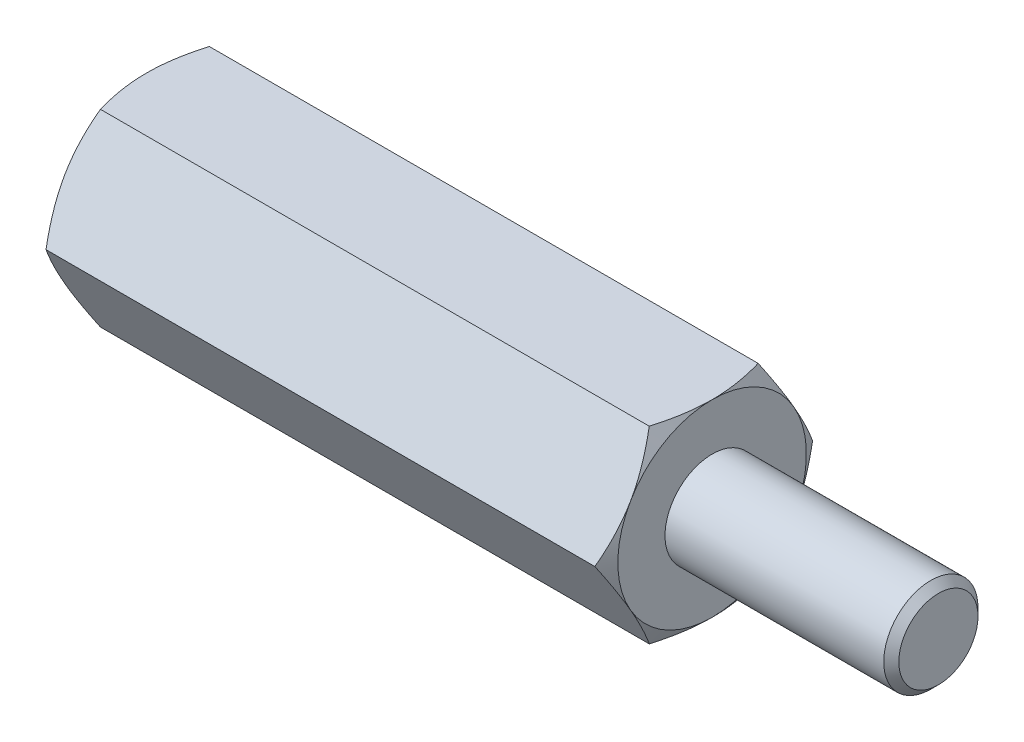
from build123d import *

# Parameters (mm, degrees)
EXTRUDE2_DEPTH = 7.5
SKETCH3_R      = 1.05
EXTRUDE3_DEPTH = 6
SKETCH5_R      = 1.25
EXTRUDE4_DEPTH = 6
CHAMFER1_SIZE  = 0.2


with BuildPart() as part:
    # Sketch1 → Extrude2 (new, symmetric)
    with BuildSketch(Plane(origin=(0, 0, 0), x_dir=(0, 0, -1), z_dir=(1, 0, 0))):
        Polygon((1.443375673, 2.5), (-1.443375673, 2.5), (-2.886751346, 0), (-1.443375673, -2.5), (1.443375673, -2.5), (2.886751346, 0), align=None)
    extrude(amount=EXTRUDE2_DEPTH, both=True)

    # Sketch2 → Cut-Revolve1 (revolve, cut)
    with BuildSketch(Plane.XY):
        with BuildLine():
            Line((-7.5, 2.5), (-6, 5.098076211))
            ThreePointArc((-6, 5.098076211), (-6.48810136, 6.276457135), (-7.5, 5.5))
            Line((-7.5, 5.5), (-7.5, 2.5))
        make_face()
    cut_revolve1 = revolve(axis=Axis((0, 0, 0), (1, 0, 0)), mode=Mode.SUBTRACT)

    # Mirror1: Cut-Revolve1 across plane
    add(cut_revolve1.mirror(Plane(origin=(0, 0, 0), x_dir=(0, 0, 1), z_dir=(1, 0, 0))), mode=Mode.SUBTRACT)

    # Sketch3 → Extrude3 (cut)
    with BuildSketch(Plane.ZY.offset(7.5)):
        Circle(SKETCH3_R)
    extrude(amount=-EXTRUDE3_DEPTH, mode=Mode.SUBTRACT)

    # Sketch4 → Cut-Revolve2 (revolve, cut)
    with BuildSketch(Plane.XY, mode=Mode.PRIVATE) as cut_revolve2_sk:
        Polygon((-1.5, 0), (-1.5, 1.05), (-0.893782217, 0), align=None)
    revolve(cut_revolve2_sk.sketch.rotate(Axis((-0.893782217, 0, 0), (-1, 0, 0)), 270), axis=Axis((-0.893782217, 0, 0), (-1, 0, 0)), mode=Mode.SUBTRACT)

    # Sketch5 → Extrude4 (add)
    with BuildSketch(Plane(origin=(7.5, 0, 0), x_dir=(0, 0, -1), z_dir=(1, 0, 0))):
        Circle(SKETCH5_R)
    extrude(amount=EXTRUDE4_DEPTH)

    # Chamfer1
    chamfer1_edges = [part.edges().sort_by_distance(p)[0] for p in [
        (13.5, 0, 1.25),
    ]]
    chamfer(chamfer1_edges, length=CHAMFER1_SIZE)


solid = part.part
